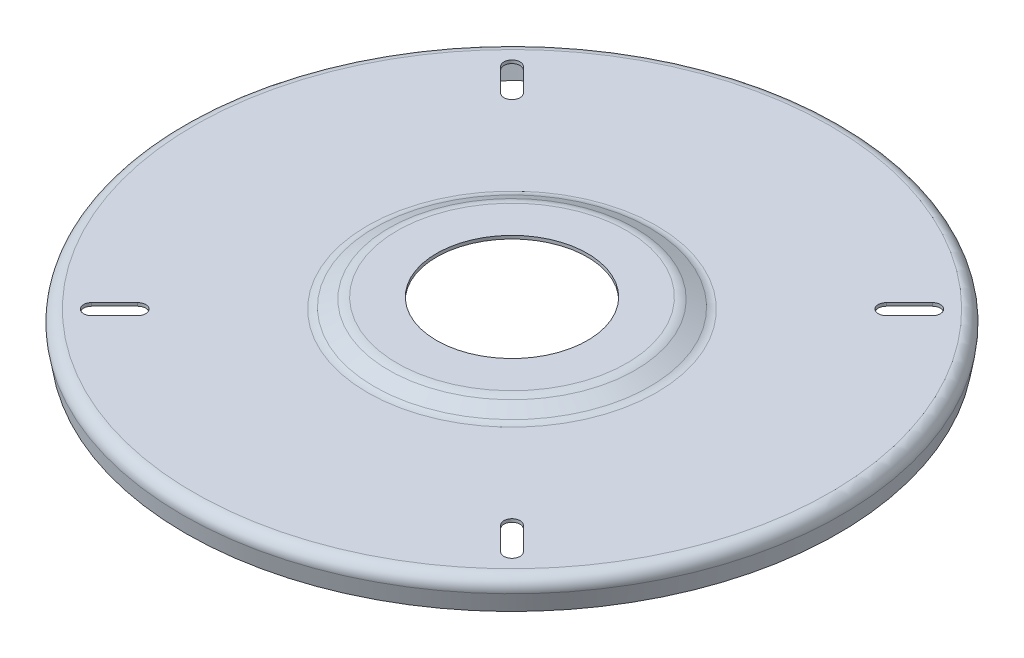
ISO-10303-21;
HEADER;
FILE_DESCRIPTION(('STEP AP214'),'2;1');
FILE_NAME('part.step','',(''),(''),'','','');
FILE_SCHEMA(('AUTOMOTIVE_DESIGN { 1 0 10303 214 1 1 1 1 }'));
ENDSEC;
DATA;
#1=APPLICATION_CONTEXT('core data for automotive mechanical design processes');
#2=APPLICATION_PROTOCOL_DEFINITION('international standard','automotive_design',2000,#1);
#3=PRODUCT_CONTEXT('',#1,'mechanical');
#4=PRODUCT('Part','Part','',(#3));
#5=PRODUCT_RELATED_PRODUCT_CATEGORY('part','',(#4));
#6=PRODUCT_DEFINITION_FORMATION('','',#4);
#7=PRODUCT_DEFINITION_CONTEXT('part definition',#1,'design');
#8=PRODUCT_DEFINITION('design','',#6,#7);
#9=PRODUCT_DEFINITION_SHAPE('','',#8);
#10=(LENGTH_UNIT() NAMED_UNIT(*) SI_UNIT(.MILLI.,.METRE.));
#11=(NAMED_UNIT(*) PLANE_ANGLE_UNIT() SI_UNIT($,.RADIAN.));
#12=(NAMED_UNIT(*) SI_UNIT($,.STERADIAN.) SOLID_ANGLE_UNIT());
#13=UNCERTAINTY_MEASURE_WITH_UNIT(LENGTH_MEASURE(1.E-05),#10,'distance_accuracy_value','');
#14=(GEOMETRIC_REPRESENTATION_CONTEXT(3) GLOBAL_UNCERTAINTY_ASSIGNED_CONTEXT((#13)) GLOBAL_UNIT_ASSIGNED_CONTEXT((#10,
#11,#12)) REPRESENTATION_CONTEXT('',''));
#15=CARTESIAN_POINT('',(0.,0.,0.));
#16=DIRECTION('',(0.,0.,1.));
#17=DIRECTION('',(1.,0.,0.));
#18=AXIS2_PLACEMENT_3D('',#15,#16,#17);
#19=CARTESIAN_POINT('',(0.,39.5209426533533,0.));
#20=DIRECTION('',(0.,-1.,0.));
#21=DIRECTION('',(0.,0.,-1.));
#22=AXIS2_PLACEMENT_3D('',#19,#20,#21);
#23=PLANE('',#22);
#24=CARTESIAN_POINT('',(0.,39.5209426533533,0.));
#25=DIRECTION('',(0.,1.,0.));
#26=DIRECTION('',(0.,0.,1.));
#27=AXIS2_PLACEMENT_3D('',#24,#25,#26);
#28=CIRCLE('',#27,71.5);
#29=CARTESIAN_POINT('',(0.,39.5209426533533,71.5));
#30=VERTEX_POINT('',#29);
#31=EDGE_CURVE('E275',#30,#30,#28,.T.);
#32=ORIENTED_EDGE('',*,*,#31,.F.);
#33=EDGE_LOOP('',(#32));
#34=FACE_BOUND('',#33,.T.);
#35=CARTESIAN_POINT('',(0.,39.5209426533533,0.));
#36=DIRECTION('',(0.,-1.,0.));
#37=DIRECTION('',(0.,0.,-1.));
#38=AXIS2_PLACEMENT_3D('',#35,#36,#37);
#39=CIRCLE('',#38,108.844372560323);
#40=CARTESIAN_POINT('',(0.,39.5209426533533,-108.844372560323));
#41=VERTEX_POINT('',#40);
#42=EDGE_CURVE('E11',#41,#41,#39,.T.);
#43=ORIENTED_EDGE('',*,*,#42,.F.);
#44=EDGE_LOOP('',(#43));
#45=FACE_BOUND('',#44,.T.);
#46=ADVANCED_FACE('F34',(#34,#45),#23,.F.);
#47=CARTESIAN_POINT('',(0.,21.5209426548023,0.));
#48=DIRECTION('',(0.,-1.,0.));
#49=DIRECTION('',(0.,0.,-1.));
#50=AXIS2_PLACEMENT_3D('',#47,#48,#49);
#51=TOROIDAL_SURFACE('',#50,108.844372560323,17.999999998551);
#52=CARTESIAN_POINT('',(0.,37.6992354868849,0.));
#53=DIRECTION('',(0.,-1.,0.));
#54=DIRECTION('',(0.,0.,-1.));
#55=AXIS2_PLACEMENT_3D('',#52,#53,#54);
#56=CIRCLE('',#55,116.735053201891);
#57=CARTESIAN_POINT('',(0.,37.6992354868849,-116.735053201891));
#58=VERTEX_POINT('',#57);
#59=EDGE_CURVE('E41',#58,#58,#56,.T.);
#60=ORIENTED_EDGE('',*,*,#59,.F.);
#61=EDGE_LOOP('',(#60));
#62=FACE_BOUND('',#61,.T.);
#63=ORIENTED_EDGE('',*,*,#42,.T.);
#64=EDGE_LOOP('',(#63));
#65=FACE_BOUND('',#64,.T.);
#66=ADVANCED_FACE('F321',(#62,#65),#51,.T.);
#67=CARTESIAN_POINT('',(0.,37.6992354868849,0.));
#68=DIRECTION('',(0.,-1.,0.));
#69=DIRECTION('',(0.,0.,-1.));
#70=AXIS2_PLACEMENT_3D('',#67,#68,#69);
#71=CONICAL_SURFACE('',#70,116.735053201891,1.11701072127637);
#72=CARTESIAN_POINT('',(0.,31.0390319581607,0.));
#73=DIRECTION('',(0.,-1.,0.));
#74=DIRECTION('',(0.,0.,-1.));
#75=AXIS2_PLACEMENT_3D('',#72,#73,#74);
#76=CIRCLE('',#75,130.390494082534);
#77=CARTESIAN_POINT('',(0.,31.0390319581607,-130.390494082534));
#78=VERTEX_POINT('',#77);
#79=EDGE_CURVE('E314',#78,#78,#76,.T.);
#80=ORIENTED_EDGE('',*,*,#79,.F.);
#81=EDGE_LOOP('',(#80));
#82=FACE_BOUND('',#81,.T.);
#83=ORIENTED_EDGE('',*,*,#59,.T.);
#84=EDGE_LOOP('',(#83));
#85=FACE_BOUND('',#84,.T.);
#86=ADVANCED_FACE('F319',(#82,#85),#71,.T.);
#87=CARTESIAN_POINT('',(0.,44.5209426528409,0.));
#88=DIRECTION('',(0.,-1.,0.));
#89=DIRECTION('',(0.,0.,-1.));
#90=AXIS2_PLACEMENT_3D('',#87,#88,#89);
#91=TOROIDAL_SURFACE('',#90,136.966061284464,15.0000000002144);
#92=CARTESIAN_POINT('',(0.,29.5209426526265,0.));
#93=DIRECTION('',(0.,-1.,0.));
#94=DIRECTION('',(0.,0.,-1.));
#95=AXIS2_PLACEMENT_3D('',#92,#93,#94);
#96=CIRCLE('',#95,136.966061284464);
#97=CARTESIAN_POINT('',(0.,29.5209426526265,-136.966061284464));
#98=VERTEX_POINT('',#97);
#99=EDGE_CURVE('E311',#98,#98,#96,.T.);
#100=ORIENTED_EDGE('',*,*,#99,.F.);
#101=EDGE_LOOP('',(#100));
#102=FACE_BOUND('',#101,.T.);
#103=ORIENTED_EDGE('',*,*,#79,.T.);
#104=EDGE_LOOP('',(#103));
#105=FACE_BOUND('',#104,.T.);
#106=ADVANCED_FACE('F401',(#102,#105),#91,.F.);
#107=CARTESIAN_POINT('',(-136.966061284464,29.5209426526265,0.));
#108=DIRECTION('',(0.,-1.,0.));
#109=DIRECTION('',(0.,0.,-1.));
#110=AXIS2_PLACEMENT_3D('',#107,#108,#109);
#111=PLANE('',#110);
#112=DIRECTION('',(0.707106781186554,0.,-0.707106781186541));
#113=VECTOR('',#112,1.);
#114=CARTESIAN_POINT('',(182.702250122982,29.5209426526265,-171.954227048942));
#115=LINE('',#114,#113);
#116=CARTESIAN_POINT('',(182.702250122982,29.5209426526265,-171.954227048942));
#117=VERTEX_POINT('',#116);
#118=CARTESIAN_POINT('',(204.495281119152,29.5209426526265,-193.747258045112));
#119=VERTEX_POINT('',#118);
#120=EDGE_CURVE('E168',#117,#119,#115,.T.);
#121=ORIENTED_EDGE('',*,*,#120,.F.);
#122=CARTESIAN_POINT('',(177.328238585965,29.5209426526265,-177.32823858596));
#123=DIRECTION('',(0.,1.,0.));
#124=DIRECTION('',(1.,0.,0.));
#125=AXIS2_PLACEMENT_3D('',#122,#123,#124);
#126=CIRCLE('',#125,7.6);
#127=CARTESIAN_POINT('',(171.954227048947,29.5209426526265,-182.702250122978));
#128=VERTEX_POINT('',#127);
#129=EDGE_CURVE('E48',#128,#117,#126,.T.);
#130=ORIENTED_EDGE('',*,*,#129,.F.);
#131=DIRECTION('',(-0.707106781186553,0.,0.707106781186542));
#132=VECTOR('',#131,1.);
#133=CARTESIAN_POINT('',(193.747258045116,29.5209426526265,-204.495281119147));
#134=LINE('',#133,#132);
#135=CARTESIAN_POINT('',(193.747258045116,29.5209426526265,-204.495281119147));
#136=VERTEX_POINT('',#135);
#137=EDGE_CURVE('E154',#136,#128,#134,.T.);
#138=ORIENTED_EDGE('',*,*,#137,.F.);
#139=CARTESIAN_POINT('',(199.121269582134,29.5209426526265,-199.121269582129));
#140=DIRECTION('',(0.,1.,0.));
#141=DIRECTION('',(1.,0.,0.));
#142=AXIS2_PLACEMENT_3D('',#139,#140,#141);
#143=CIRCLE('',#142,7.60000000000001);
#144=EDGE_CURVE('E174',#119,#136,#143,.T.);
#145=ORIENTED_EDGE('',*,*,#144,.F.);
#146=EDGE_LOOP('',(#121,#130,#138,#145));
#147=FACE_BOUND('',#146,.T.);
#148=DIRECTION('',(-0.707106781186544,0.,-0.707106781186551));
#149=VECTOR('',#148,1.);
#150=CARTESIAN_POINT('',(-171.954227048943,29.5209426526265,-182.702250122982));
#151=LINE('',#150,#149);
#152=CARTESIAN_POINT('',(-171.954227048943,29.5209426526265,-182.702250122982));
#153=VERTEX_POINT('',#152);
#154=CARTESIAN_POINT('',(-193.747258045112,29.5209426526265,-204.495281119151));
#155=VERTEX_POINT('',#154);
#156=EDGE_CURVE('E192',#153,#155,#151,.T.);
#157=ORIENTED_EDGE('',*,*,#156,.F.);
#158=CARTESIAN_POINT('',(-177.328238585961,29.5209426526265,-177.328238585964));
#159=DIRECTION('',(0.,1.,0.));
#160=DIRECTION('',(0.,0.,-1.));
#161=AXIS2_PLACEMENT_3D('',#158,#159,#160);
#162=CIRCLE('',#161,7.6);
#163=CARTESIAN_POINT('',(-182.702250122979,29.5209426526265,-171.954227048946));
#164=VERTEX_POINT('',#163);
#165=EDGE_CURVE('E190',#164,#153,#162,.T.);
#166=ORIENTED_EDGE('',*,*,#165,.F.);
#167=DIRECTION('',(0.707106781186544,0.,0.707106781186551));
#168=VECTOR('',#167,1.);
#169=CARTESIAN_POINT('',(-204.495281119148,29.5209426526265,-193.747258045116));
#170=LINE('',#169,#168);
#171=CARTESIAN_POINT('',(-204.495281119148,29.5209426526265,-193.747258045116));
#172=VERTEX_POINT('',#171);
#173=EDGE_CURVE('E198',#172,#164,#170,.T.);
#174=ORIENTED_EDGE('',*,*,#173,.F.);
#175=CARTESIAN_POINT('',(-199.12126958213,29.5209426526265,-199.121269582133));
#176=DIRECTION('',(0.,1.,0.));
#177=DIRECTION('',(0.,0.,-1.));
#178=AXIS2_PLACEMENT_3D('',#175,#176,#177);
#179=CIRCLE('',#178,7.60000000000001);
#180=EDGE_CURVE('E195',#155,#172,#179,.T.);
#181=ORIENTED_EDGE('',*,*,#180,.F.);
#182=EDGE_LOOP('',(#157,#166,#174,#181));
#183=FACE_BOUND('',#182,.T.);
#184=DIRECTION('',(-0.707106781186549,0.,0.707106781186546));
#185=VECTOR('',#184,1.);
#186=CARTESIAN_POINT('',(-182.702250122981,29.5209426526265,171.954227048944));
#187=LINE('',#186,#185);
#188=CARTESIAN_POINT('',(-182.702250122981,29.5209426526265,171.954227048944));
#189=VERTEX_POINT('',#188);
#190=CARTESIAN_POINT('',(-204.495281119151,29.5209426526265,193.747258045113));
#191=VERTEX_POINT('',#190);
#192=EDGE_CURVE('E223',#189,#191,#187,.T.);
#193=ORIENTED_EDGE('',*,*,#192,.F.);
#194=CARTESIAN_POINT('',(-177.328238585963,29.5209426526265,177.328238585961));
#195=DIRECTION('',(0.,1.,0.));
#196=DIRECTION('',(-1.,0.,0.));
#197=AXIS2_PLACEMENT_3D('',#194,#195,#196);
#198=CIRCLE('',#197,7.6);
#199=CARTESIAN_POINT('',(-171.954227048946,29.5209426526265,182.702250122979));
#200=VERTEX_POINT('',#199);
#201=EDGE_CURVE('E221',#200,#189,#198,.T.);
#202=ORIENTED_EDGE('',*,*,#201,.F.);
#203=DIRECTION('',(0.707106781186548,0.,-0.707106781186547));
#204=VECTOR('',#203,1.);
#205=CARTESIAN_POINT('',(-193.747258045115,29.5209426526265,204.495281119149));
#206=LINE('',#205,#204);
#207=CARTESIAN_POINT('',(-193.747258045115,29.5209426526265,204.495281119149));
#208=VERTEX_POINT('',#207);
#209=EDGE_CURVE('E229',#208,#200,#206,.T.);
#210=ORIENTED_EDGE('',*,*,#209,.F.);
#211=CARTESIAN_POINT('',(-199.121269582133,29.5209426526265,199.121269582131));
#212=DIRECTION('',(0.,1.,0.));
#213=DIRECTION('',(-1.,0.,0.));
#214=AXIS2_PLACEMENT_3D('',#211,#212,#213);
#215=CIRCLE('',#214,7.60000000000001);
#216=EDGE_CURVE('E226',#191,#208,#215,.T.);
#217=ORIENTED_EDGE('',*,*,#216,.F.);
#218=EDGE_LOOP('',(#193,#202,#210,#217));
#219=FACE_BOUND('',#218,.T.);
#220=DIRECTION('',(0.707106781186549,0.,0.707106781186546));
#221=VECTOR('',#220,1.);
#222=CARTESIAN_POINT('',(171.954227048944,29.5209426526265,182.702250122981));
#223=LINE('',#222,#221);
#224=CARTESIAN_POINT('',(171.954227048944,29.5209426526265,182.702250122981));
#225=VERTEX_POINT('',#224);
#226=CARTESIAN_POINT('',(193.747258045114,29.5209426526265,204.49528111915));
#227=VERTEX_POINT('',#226);
#228=EDGE_CURVE('E254',#225,#227,#223,.T.);
#229=ORIENTED_EDGE('',*,*,#228,.F.);
#230=CARTESIAN_POINT('',(177.328238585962,29.5209426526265,177.328238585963));
#231=DIRECTION('',(0.,1.,0.));
#232=DIRECTION('',(0.,0.,1.));
#233=AXIS2_PLACEMENT_3D('',#230,#231,#232);
#234=CIRCLE('',#233,7.6);
#235=CARTESIAN_POINT('',(182.70225012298,29.5209426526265,171.954227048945));
#236=VERTEX_POINT('',#235);
#237=EDGE_CURVE('E252',#236,#225,#234,.T.);
#238=ORIENTED_EDGE('',*,*,#237,.F.);
#239=DIRECTION('',(-0.707106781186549,0.,-0.707106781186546));
#240=VECTOR('',#239,1.);
#241=CARTESIAN_POINT('',(204.495281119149,29.5209426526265,193.747258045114));
#242=LINE('',#241,#240);
#243=CARTESIAN_POINT('',(204.495281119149,29.5209426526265,193.747258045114));
#244=VERTEX_POINT('',#243);
#245=EDGE_CURVE('E260',#244,#236,#242,.T.);
#246=ORIENTED_EDGE('',*,*,#245,.F.);
#247=CARTESIAN_POINT('',(199.121269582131,29.5209426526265,199.121269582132));
#248=DIRECTION('',(0.,1.,0.));
#249=DIRECTION('',(0.,0.,1.));
#250=AXIS2_PLACEMENT_3D('',#247,#248,#249);
#251=CIRCLE('',#250,7.60000000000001);
#252=EDGE_CURVE('E257',#227,#244,#251,.T.);
#253=ORIENTED_EDGE('',*,*,#252,.F.);
#254=EDGE_LOOP('',(#229,#238,#246,#253));
#255=FACE_BOUND('',#254,.T.);
#256=CARTESIAN_POINT('',(0.,29.5209426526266,0.));
#257=DIRECTION('',(0.,-1.,0.));
#258=DIRECTION('',(0.,0.,-1.));
#259=AXIS2_PLACEMENT_3D('',#256,#257,#258);
#260=CIRCLE('',#259,301.277);
#261=CARTESIAN_POINT('',(0.,29.5209426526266,-301.277));
#262=VERTEX_POINT('',#261);
#263=EDGE_CURVE('E308',#262,#262,#260,.T.);
#264=ORIENTED_EDGE('',*,*,#263,.F.);
#265=EDGE_LOOP('',(#264));
#266=FACE_BOUND('',#265,.T.);
#267=ORIENTED_EDGE('',*,*,#99,.T.);
#268=EDGE_LOOP('',(#267));
#269=FACE_BOUND('',#268,.T.);
#270=ADVANCED_FACE('F395',(#147,#183,#219,#255,#266,#269),#111,.F.);
#271=CARTESIAN_POINT('',(0.,18.5208261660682,0.));
#272=DIRECTION('',(0.,-1.,0.));
#273=DIRECTION('',(0.,0.,-1.));
#274=AXIS2_PLACEMENT_3D('',#271,#272,#273);
#275=TOROIDAL_SURFACE('',#274,301.277,11.0001164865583);
#276=CARTESIAN_POINT('',(0.,16.6106759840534,0.));
#277=DIRECTION('',(0.,-1.,0.));
#278=DIRECTION('',(0.,0.,-1.));
#279=AXIS2_PLACEMENT_3D('',#276,#277,#278);
#280=CIRCLE('',#279,312.11);
#281=CARTESIAN_POINT('',(0.,16.6106759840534,-312.11));
#282=VERTEX_POINT('',#281);
#283=EDGE_CURVE('E305',#282,#282,#280,.T.);
#284=ORIENTED_EDGE('',*,*,#283,.F.);
#285=EDGE_LOOP('',(#284));
#286=FACE_BOUND('',#285,.T.);
#287=ORIENTED_EDGE('',*,*,#263,.T.);
#288=EDGE_LOOP('',(#287));
#289=FACE_BOUND('',#288,.T.);
#290=ADVANCED_FACE('F389',(#286,#289),#275,.T.);
#291=CARTESIAN_POINT('',(0.,16.6106759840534,0.));
#292=DIRECTION('',(0.,1.,0.));
#293=DIRECTION('',(0.,0.,1.));
#294=AXIS2_PLACEMENT_3D('',#291,#292,#293);
#295=CONICAL_SURFACE('',#294,312.11,0.174532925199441);
#296=CARTESIAN_POINT('',(0.,0.,0.));
#297=DIRECTION('',(0.,-1.,0.));
#298=DIRECTION('',(0.,0.,-1.));
#299=AXIS2_PLACEMENT_3D('',#296,#297,#298);
#300=CIRCLE('',#299,309.181089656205);
#301=CARTESIAN_POINT('',(0.,0.,-309.181089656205));
#302=VERTEX_POINT('',#301);
#303=EDGE_CURVE('E302',#302,#302,#300,.T.);
#304=ORIENTED_EDGE('',*,*,#303,.F.);
#305=EDGE_LOOP('',(#304));
#306=FACE_BOUND('',#305,.T.);
#307=ORIENTED_EDGE('',*,*,#283,.T.);
#308=EDGE_LOOP('',(#307));
#309=FACE_BOUND('',#308,.T.);
#310=ADVANCED_FACE('F383',(#306,#309),#295,.T.);
#311=CARTESIAN_POINT('',(0.,0.,0.));
#312=DIRECTION('',(0.,-1.,0.));
#313=DIRECTION('',(0.,0.,-1.));
#314=AXIS2_PLACEMENT_3D('',#311,#312,#313);
#315=CONICAL_SURFACE('',#314,309.181089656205,1.39626340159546);
#316=CARTESIAN_POINT('',(0.,0.520944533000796,0.));
#317=DIRECTION('',(0.,-1.,0.));
#318=DIRECTION('',(0.,0.,-1.));
#319=AXIS2_PLACEMENT_3D('',#316,#317,#318);
#320=CIRCLE('',#319,306.226666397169);
#321=CARTESIAN_POINT('',(0.,0.520944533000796,-306.226666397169));
#322=VERTEX_POINT('',#321);
#323=EDGE_CURVE('E299',#322,#322,#320,.T.);
#324=ORIENTED_EDGE('',*,*,#323,.F.);
#325=EDGE_LOOP('',(#324));
#326=FACE_BOUND('',#325,.T.);
#327=ORIENTED_EDGE('',*,*,#303,.T.);
#328=EDGE_LOOP('',(#327));
#329=FACE_BOUND('',#328,.T.);
#330=ADVANCED_FACE('F377',(#326,#329),#315,.F.);
#331=CARTESIAN_POINT('',(0.,0.520944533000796,0.));
#332=DIRECTION('',(0.,1.,0.));
#333=DIRECTION('',(0.,0.,1.));
#334=AXIS2_PLACEMENT_3D('',#331,#332,#333);
#335=CONICAL_SURFACE('',#334,306.226666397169,0.174532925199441);
#336=CARTESIAN_POINT('',(0.,17.1316205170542,0.));
#337=DIRECTION('',(0.,-1.,0.));
#338=DIRECTION('',(0.,0.,-1.));
#339=AXIS2_PLACEMENT_3D('',#336,#337,#338);
#340=CIRCLE('',#339,309.155576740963);
#341=CARTESIAN_POINT('',(0.,17.1316205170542,-309.155576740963));
#342=VERTEX_POINT('',#341);
#343=EDGE_CURVE('E296',#342,#342,#340,.T.);
#344=ORIENTED_EDGE('',*,*,#343,.F.);
#345=EDGE_LOOP('',(#344));
#346=FACE_BOUND('',#345,.T.);
#347=ORIENTED_EDGE('',*,*,#323,.T.);
#348=EDGE_LOOP('',(#347));
#349=FACE_BOUND('',#348,.T.);
#350=ADVANCED_FACE('F371',(#346,#349),#335,.F.);
#351=CARTESIAN_POINT('',(0.,18.5208261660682,0.));
#352=DIRECTION('',(0.,-1.,0.));
#353=DIRECTION('',(0.,0.,-1.));
#354=AXIS2_PLACEMENT_3D('',#351,#352,#353);
#355=TOROIDAL_SURFACE('',#354,301.277,8.00011648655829);
#356=CARTESIAN_POINT('',(0.,26.5209426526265,0.));
#357=DIRECTION('',(0.,-1.,0.));
#358=DIRECTION('',(0.,0.,-1.));
#359=AXIS2_PLACEMENT_3D('',#356,#357,#358);
#360=CIRCLE('',#359,301.277);
#361=CARTESIAN_POINT('',(0.,26.5209426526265,-301.277));
#362=VERTEX_POINT('',#361);
#363=EDGE_CURVE('E293',#362,#362,#360,.T.);
#364=ORIENTED_EDGE('',*,*,#363,.F.);
#365=EDGE_LOOP('',(#364));
#366=FACE_BOUND('',#365,.T.);
#367=ORIENTED_EDGE('',*,*,#343,.T.);
#368=EDGE_LOOP('',(#367));
#369=FACE_BOUND('',#368,.T.);
#370=ADVANCED_FACE('F365',(#366,#369),#355,.F.);
#371=CARTESIAN_POINT('',(-136.966061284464,26.5209426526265,0.));
#372=DIRECTION('',(0.,1.,0.));
#373=DIRECTION('',(0.,0.,1.));
#374=AXIS2_PLACEMENT_3D('',#371,#372,#373);
#375=PLANE('',#374);
#376=DIRECTION('',(0.707106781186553,0.,-0.707106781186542));
#377=VECTOR('',#376,1.);
#378=CARTESIAN_POINT('',(193.747258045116,26.5209426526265,-204.495281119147));
#379=LINE('',#378,#377);
#380=CARTESIAN_POINT('',(171.954227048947,26.5209426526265,-182.702250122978));
#381=VERTEX_POINT('',#380);
#382=CARTESIAN_POINT('',(193.747258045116,26.5209426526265,-204.495281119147));
#383=VERTEX_POINT('',#382);
#384=EDGE_CURVE('E166',#381,#383,#379,.T.);
#385=ORIENTED_EDGE('',*,*,#384,.F.);
#386=CARTESIAN_POINT('',(177.328238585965,26.5209426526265,-177.32823858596));
#387=DIRECTION('',(0.,1.,0.));
#388=DIRECTION('',(0.,0.,1.));
#389=AXIS2_PLACEMENT_3D('',#386,#387,#388);
#390=CIRCLE('',#389,7.6);
#391=CARTESIAN_POINT('',(182.702250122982,26.5209426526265,-171.954227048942));
#392=VERTEX_POINT('',#391);
#393=EDGE_CURVE('E148',#392,#381,#390,.F.);
#394=ORIENTED_EDGE('',*,*,#393,.F.);
#395=DIRECTION('',(-0.707106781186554,0.,0.707106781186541));
#396=VECTOR('',#395,1.);
#397=CARTESIAN_POINT('',(182.702250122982,26.5209426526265,-171.954227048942));
#398=LINE('',#397,#396);
#399=CARTESIAN_POINT('',(204.495281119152,26.5209426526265,-193.747258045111));
#400=VERTEX_POINT('',#399);
#401=EDGE_CURVE('E157',#400,#392,#398,.T.);
#402=ORIENTED_EDGE('',*,*,#401,.F.);
#403=CARTESIAN_POINT('',(199.121269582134,26.5209426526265,-199.121269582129));
#404=DIRECTION('',(0.,1.,0.));
#405=DIRECTION('',(0.,0.,1.));
#406=AXIS2_PLACEMENT_3D('',#403,#404,#405);
#407=CIRCLE('',#406,7.60000000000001);
#408=EDGE_CURVE('E56',#383,#400,#407,.F.);
#409=ORIENTED_EDGE('',*,*,#408,.F.);
#410=EDGE_LOOP('',(#385,#394,#402,#409));
#411=FACE_BOUND('',#410,.T.);
#412=DIRECTION('',(-0.707106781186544,0.,-0.707106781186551));
#413=VECTOR('',#412,1.);
#414=CARTESIAN_POINT('',(-204.495281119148,26.5209426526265,-193.747258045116));
#415=LINE('',#414,#413);
#416=CARTESIAN_POINT('',(-182.702250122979,26.5209426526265,-171.954227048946));
#417=VERTEX_POINT('',#416);
#418=CARTESIAN_POINT('',(-204.495281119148,26.5209426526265,-193.747258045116));
#419=VERTEX_POINT('',#418);
#420=EDGE_CURVE('E184',#417,#419,#415,.T.);
#421=ORIENTED_EDGE('',*,*,#420,.F.);
#422=CARTESIAN_POINT('',(-177.328238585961,26.5209426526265,-177.328238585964));
#423=DIRECTION('',(0.,1.,0.));
#424=DIRECTION('',(0.,0.,1.));
#425=AXIS2_PLACEMENT_3D('',#422,#423,#424);
#426=CIRCLE('',#425,7.6);
#427=CARTESIAN_POINT('',(-171.954227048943,26.5209426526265,-182.702250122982));
#428=VERTEX_POINT('',#427);
#429=EDGE_CURVE('E187',#428,#417,#426,.F.);
#430=ORIENTED_EDGE('',*,*,#429,.F.);
#431=DIRECTION('',(0.707106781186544,0.,0.707106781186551));
#432=VECTOR('',#431,1.);
#433=CARTESIAN_POINT('',(-171.954227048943,26.5209426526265,-182.702250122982));
#434=LINE('',#433,#432);
#435=CARTESIAN_POINT('',(-193.747258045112,26.5209426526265,-204.495281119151));
#436=VERTEX_POINT('',#435);
#437=EDGE_CURVE('E204',#436,#428,#434,.T.);
#438=ORIENTED_EDGE('',*,*,#437,.F.);
#439=CARTESIAN_POINT('',(-199.12126958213,26.5209426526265,-199.121269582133));
#440=DIRECTION('',(0.,1.,0.));
#441=DIRECTION('',(0.,0.,1.));
#442=AXIS2_PLACEMENT_3D('',#439,#440,#441);
#443=CIRCLE('',#442,7.60000000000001);
#444=EDGE_CURVE('E160',#419,#436,#443,.F.);
#445=ORIENTED_EDGE('',*,*,#444,.F.);
#446=EDGE_LOOP('',(#421,#430,#438,#445));
#447=FACE_BOUND('',#446,.T.);
#448=DIRECTION('',(-0.707106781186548,0.,0.707106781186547));
#449=VECTOR('',#448,1.);
#450=CARTESIAN_POINT('',(-193.747258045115,26.5209426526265,204.495281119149));
#451=LINE('',#450,#449);
#452=CARTESIAN_POINT('',(-171.954227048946,26.5209426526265,182.702250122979));
#453=VERTEX_POINT('',#452);
#454=CARTESIAN_POINT('',(-193.747258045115,26.5209426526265,204.495281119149));
#455=VERTEX_POINT('',#454);
#456=EDGE_CURVE('E215',#453,#455,#451,.T.);
#457=ORIENTED_EDGE('',*,*,#456,.F.);
#458=CARTESIAN_POINT('',(-177.328238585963,26.5209426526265,177.328238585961));
#459=DIRECTION('',(0.,1.,0.));
#460=DIRECTION('',(0.,0.,1.));
#461=AXIS2_PLACEMENT_3D('',#458,#459,#460);
#462=CIRCLE('',#461,7.6);
#463=CARTESIAN_POINT('',(-182.702250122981,26.5209426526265,171.954227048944));
#464=VERTEX_POINT('',#463);
#465=EDGE_CURVE('E218',#464,#453,#462,.F.);
#466=ORIENTED_EDGE('',*,*,#465,.F.);
#467=DIRECTION('',(0.707106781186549,0.,-0.707106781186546));
#468=VECTOR('',#467,1.);
#469=CARTESIAN_POINT('',(-182.702250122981,26.5209426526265,171.954227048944));
#470=LINE('',#469,#468);
#471=CARTESIAN_POINT('',(-204.495281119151,26.5209426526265,193.747258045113));
#472=VERTEX_POINT('',#471);
#473=EDGE_CURVE('E235',#472,#464,#470,.T.);
#474=ORIENTED_EDGE('',*,*,#473,.F.);
#475=CARTESIAN_POINT('',(-199.121269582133,26.5209426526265,199.121269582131));
#476=DIRECTION('',(0.,1.,0.));
#477=DIRECTION('',(0.,0.,1.));
#478=AXIS2_PLACEMENT_3D('',#475,#476,#477);
#479=CIRCLE('',#478,7.60000000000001);
#480=EDGE_CURVE('E213',#455,#472,#479,.F.);
#481=ORIENTED_EDGE('',*,*,#480,.F.);
#482=EDGE_LOOP('',(#457,#466,#474,#481));
#483=FACE_BOUND('',#482,.T.);
#484=DIRECTION('',(0.707106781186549,0.,0.707106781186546));
#485=VECTOR('',#484,1.);
#486=CARTESIAN_POINT('',(204.495281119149,26.5209426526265,193.747258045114));
#487=LINE('',#486,#485);
#488=CARTESIAN_POINT('',(182.70225012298,26.5209426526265,171.954227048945));
#489=VERTEX_POINT('',#488);
#490=CARTESIAN_POINT('',(204.495281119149,26.5209426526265,193.747258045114));
#491=VERTEX_POINT('',#490);
#492=EDGE_CURVE('E246',#489,#491,#487,.T.);
#493=ORIENTED_EDGE('',*,*,#492,.F.);
#494=CARTESIAN_POINT('',(177.328238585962,26.5209426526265,177.328238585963));
#495=DIRECTION('',(0.,1.,0.));
#496=DIRECTION('',(0.,0.,1.));
#497=AXIS2_PLACEMENT_3D('',#494,#495,#496);
#498=CIRCLE('',#497,7.6);
#499=CARTESIAN_POINT('',(171.954227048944,26.5209426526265,182.702250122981));
#500=VERTEX_POINT('',#499);
#501=EDGE_CURVE('E249',#500,#489,#498,.F.);
#502=ORIENTED_EDGE('',*,*,#501,.F.);
#503=DIRECTION('',(-0.707106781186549,0.,-0.707106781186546));
#504=VECTOR('',#503,1.);
#505=CARTESIAN_POINT('',(171.954227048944,26.5209426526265,182.702250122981));
#506=LINE('',#505,#504);
#507=CARTESIAN_POINT('',(193.747258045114,26.5209426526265,204.49528111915));
#508=VERTEX_POINT('',#507);
#509=EDGE_CURVE('E266',#508,#500,#506,.T.);
#510=ORIENTED_EDGE('',*,*,#509,.F.);
#511=CARTESIAN_POINT('',(199.121269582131,26.5209426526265,199.121269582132));
#512=DIRECTION('',(0.,1.,0.));
#513=DIRECTION('',(0.,0.,1.));
#514=AXIS2_PLACEMENT_3D('',#511,#512,#513);
#515=CIRCLE('',#514,7.60000000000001);
#516=EDGE_CURVE('E244',#491,#508,#515,.F.);
#517=ORIENTED_EDGE('',*,*,#516,.F.);
#518=EDGE_LOOP('',(#493,#502,#510,#517));
#519=FACE_BOUND('',#518,.T.);
#520=CARTESIAN_POINT('',(0.,26.5209426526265,0.));
#521=DIRECTION('',(0.,-1.,0.));
#522=DIRECTION('',(0.,0.,-1.));
#523=AXIS2_PLACEMENT_3D('',#520,#521,#522);
#524=CIRCLE('',#523,136.966061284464);
#525=CARTESIAN_POINT('',(0.,26.5209426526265,-136.966061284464));
#526=VERTEX_POINT('',#525);
#527=EDGE_CURVE('E290',#526,#526,#524,.T.);
#528=ORIENTED_EDGE('',*,*,#527,.F.);
#529=EDGE_LOOP('',(#528));
#530=FACE_BOUND('',#529,.T.);
#531=ORIENTED_EDGE('',*,*,#363,.T.);
#532=EDGE_LOOP('',(#531));
#533=FACE_BOUND('',#532,.T.);
#534=ADVANCED_FACE('F163',(#411,#447,#483,#519,#530,#533),#375,.F.);
#535=CARTESIAN_POINT('',(0.,44.5209426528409,0.));
#536=DIRECTION('',(0.,-1.,0.));
#537=DIRECTION('',(0.,0.,-1.));
#538=AXIS2_PLACEMENT_3D('',#535,#536,#537);
#539=TOROIDAL_SURFACE('',#538,136.966061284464,18.0000000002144);
#540=CARTESIAN_POINT('',(0.,28.3426498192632,0.));
#541=DIRECTION('',(0.,-1.,0.));
#542=DIRECTION('',(0.,0.,-1.));
#543=AXIS2_PLACEMENT_3D('',#540,#541,#542);
#544=CIRCLE('',#543,129.075380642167);
#545=CARTESIAN_POINT('',(0.,28.3426498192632,-129.075380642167));
#546=VERTEX_POINT('',#545);
#547=EDGE_CURVE('E287',#546,#546,#544,.T.);
#548=ORIENTED_EDGE('',*,*,#547,.F.);
#549=EDGE_LOOP('',(#548));
#550=FACE_BOUND('',#549,.T.);
#551=ORIENTED_EDGE('',*,*,#527,.T.);
#552=EDGE_LOOP('',(#551));
#553=FACE_BOUND('',#552,.T.);
#554=ADVANCED_FACE('F354',(#550,#553),#539,.T.);
#555=CARTESIAN_POINT('',(0.,28.3426498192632,0.));
#556=DIRECTION('',(0.,-1.,0.));
#557=DIRECTION('',(0.,0.,-1.));
#558=AXIS2_PLACEMENT_3D('',#555,#556,#557);
#559=CONICAL_SURFACE('',#558,129.075380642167,1.11701072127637);
#560=CARTESIAN_POINT('',(0.,35.0028533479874,0.));
#561=DIRECTION('',(0.,-1.,0.));
#562=DIRECTION('',(0.,0.,-1.));
#563=AXIS2_PLACEMENT_3D('',#560,#561,#562);
#564=CIRCLE('',#563,115.419939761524);
#565=CARTESIAN_POINT('',(0.,35.0028533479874,-115.419939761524));
#566=VERTEX_POINT('',#565);
#567=EDGE_CURVE('E284',#566,#566,#564,.T.);
#568=ORIENTED_EDGE('',*,*,#567,.F.);
#569=EDGE_LOOP('',(#568));
#570=FACE_BOUND('',#569,.T.);
#571=ORIENTED_EDGE('',*,*,#547,.T.);
#572=EDGE_LOOP('',(#571));
#573=FACE_BOUND('',#572,.T.);
#574=ADVANCED_FACE('F348',(#570,#573),#559,.F.);
#575=CARTESIAN_POINT('',(0.,21.5209426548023,0.));
#576=DIRECTION('',(0.,-1.,0.));
#577=DIRECTION('',(0.,0.,-1.));
#578=AXIS2_PLACEMENT_3D('',#575,#576,#577);
#579=TOROIDAL_SURFACE('',#578,108.844372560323,14.999999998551);
#580=CARTESIAN_POINT('',(0.,36.5209426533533,0.));
#581=DIRECTION('',(0.,-1.,0.));
#582=DIRECTION('',(0.,0.,-1.));
#583=AXIS2_PLACEMENT_3D('',#580,#581,#582);
#584=CIRCLE('',#583,108.844372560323);
#585=CARTESIAN_POINT('',(0.,36.5209426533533,-108.844372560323));
#586=VERTEX_POINT('',#585);
#587=EDGE_CURVE('E281',#586,#586,#584,.T.);
#588=ORIENTED_EDGE('',*,*,#587,.F.);
#589=EDGE_LOOP('',(#588));
#590=FACE_BOUND('',#589,.T.);
#591=ORIENTED_EDGE('',*,*,#567,.T.);
#592=EDGE_LOOP('',(#591));
#593=FACE_BOUND('',#592,.T.);
#594=ADVANCED_FACE('F342',(#590,#593),#579,.F.);
#595=CARTESIAN_POINT('',(0.,36.5209426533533,0.));
#596=DIRECTION('',(0.,1.,0.));
#597=DIRECTION('',(0.,0.,1.));
#598=AXIS2_PLACEMENT_3D('',#595,#596,#597);
#599=PLANE('',#598);
#600=CARTESIAN_POINT('',(0.,36.5209426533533,0.));
#601=DIRECTION('',(0.,1.,0.));
#602=DIRECTION('',(0.,0.,1.));
#603=AXIS2_PLACEMENT_3D('',#600,#601,#602);
#604=CIRCLE('',#603,71.5);
#605=CARTESIAN_POINT('',(0.,36.5209426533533,71.5));
#606=VERTEX_POINT('',#605);
#607=EDGE_CURVE('E278',#606,#606,#604,.F.);
#608=ORIENTED_EDGE('',*,*,#607,.F.);
#609=EDGE_LOOP('',(#608));
#610=FACE_BOUND('',#609,.T.);
#611=ORIENTED_EDGE('',*,*,#587,.T.);
#612=EDGE_LOOP('',(#611));
#613=FACE_BOUND('',#612,.T.);
#614=ADVANCED_FACE('F336',(#610,#613),#599,.F.);
#615=CARTESIAN_POINT('',(0.,-0.001000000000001,0.));
#616=DIRECTION('',(0.,1.,0.));
#617=DIRECTION('',(0.,0.,1.));
#618=AXIS2_PLACEMENT_3D('',#615,#616,#617);
#619=CYLINDRICAL_SURFACE('',#618,71.5);
#620=ORIENTED_EDGE('',*,*,#31,.T.);
#621=EDGE_LOOP('',(#620));
#622=FACE_BOUND('',#621,.T.);
#623=ORIENTED_EDGE('',*,*,#607,.T.);
#624=EDGE_LOOP('',(#623));
#625=FACE_BOUND('',#624,.T.);
#626=ADVANCED_FACE('F332',(#622,#625),#619,.F.);
#627=CARTESIAN_POINT('',(177.328238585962,-0.001000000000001,177.328238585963));
#628=DIRECTION('',(0.,1.,0.));
#629=DIRECTION('',(0.,0.,1.));
#630=AXIS2_PLACEMENT_3D('',#627,#628,#629);
#631=CYLINDRICAL_SURFACE('',#630,7.6);
#632=ORIENTED_EDGE('',*,*,#501,.T.);
#633=DIRECTION('',(0.,1.,0.));
#634=VECTOR('',#633,1.);
#635=CARTESIAN_POINT('',(182.70225012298,-0.001000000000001,171.954227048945));
#636=LINE('',#635,#634);
#637=EDGE_CURVE('E264',#489,#236,#636,.T.);
#638=ORIENTED_EDGE('',*,*,#637,.T.);
#639=ORIENTED_EDGE('',*,*,#237,.T.);
#640=DIRECTION('',(0.,1.,0.));
#641=VECTOR('',#640,1.);
#642=CARTESIAN_POINT('',(171.954227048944,-0.001000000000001,182.702250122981));
#643=LINE('',#642,#641);
#644=EDGE_CURVE('E263',#500,#225,#643,.T.);
#645=ORIENTED_EDGE('',*,*,#644,.F.);
#646=EDGE_LOOP('',(#632,#638,#639,#645));
#647=FACE_BOUND('',#646,.T.);
#648=ADVANCED_FACE('F335',(#647),#631,.F.);
#649=CARTESIAN_POINT('',(204.495281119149,-0.001000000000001,193.747258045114));
#650=DIRECTION('',(0.707106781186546,0.,-0.707106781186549));
#651=DIRECTION('',(-0.707106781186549,0.,-0.707106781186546));
#652=AXIS2_PLACEMENT_3D('',#649,#650,#651);
#653=PLANE('',#652);
#654=ORIENTED_EDGE('',*,*,#492,.T.);
#655=DIRECTION('',(0.,1.,0.));
#656=VECTOR('',#655,1.);
#657=CARTESIAN_POINT('',(204.495281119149,-0.001000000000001,193.747258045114));
#658=LINE('',#657,#656);
#659=EDGE_CURVE('E267',#491,#244,#658,.T.);
#660=ORIENTED_EDGE('',*,*,#659,.T.);
#661=ORIENTED_EDGE('',*,*,#245,.T.);
#662=ORIENTED_EDGE('',*,*,#637,.F.);
#663=EDGE_LOOP('',(#654,#660,#661,#662));
#664=FACE_BOUND('',#663,.T.);
#665=ADVANCED_FACE('F418',(#664),#653,.F.);
#666=CARTESIAN_POINT('',(199.121269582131,-0.001000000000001,199.121269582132));
#667=DIRECTION('',(0.,1.,0.));
#668=DIRECTION('',(0.,0.,1.));
#669=AXIS2_PLACEMENT_3D('',#666,#667,#668);
#670=CYLINDRICAL_SURFACE('',#669,7.60000000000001);
#671=ORIENTED_EDGE('',*,*,#516,.T.);
#672=DIRECTION('',(0.,1.,0.));
#673=VECTOR('',#672,1.);
#674=CARTESIAN_POINT('',(193.747258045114,-0.001000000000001,204.49528111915));
#675=LINE('',#674,#673);
#676=EDGE_CURVE('E269',#508,#227,#675,.T.);
#677=ORIENTED_EDGE('',*,*,#676,.T.);
#678=ORIENTED_EDGE('',*,*,#252,.T.);
#679=ORIENTED_EDGE('',*,*,#659,.F.);
#680=EDGE_LOOP('',(#671,#677,#678,#679));
#681=FACE_BOUND('',#680,.T.);
#682=ADVANCED_FACE('F424',(#681),#670,.F.);
#683=CARTESIAN_POINT('',(171.954227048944,-0.001000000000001,182.702250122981));
#684=DIRECTION('',(-0.707106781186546,0.,0.707106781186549));
#685=DIRECTION('',(0.707106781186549,0.,0.707106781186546));
#686=AXIS2_PLACEMENT_3D('',#683,#684,#685);
#687=PLANE('',#686);
#688=ORIENTED_EDGE('',*,*,#509,.T.);
#689=ORIENTED_EDGE('',*,*,#644,.T.);
#690=ORIENTED_EDGE('',*,*,#228,.T.);
#691=ORIENTED_EDGE('',*,*,#676,.F.);
#692=EDGE_LOOP('',(#688,#689,#690,#691));
#693=FACE_BOUND('',#692,.T.);
#694=ADVANCED_FACE('F420',(#693),#687,.F.);
#695=CARTESIAN_POINT('',(-177.328238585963,-0.001000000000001,177.328238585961));
#696=DIRECTION('',(0.,1.,0.));
#697=DIRECTION('',(0.,0.,1.));
#698=AXIS2_PLACEMENT_3D('',#695,#696,#697);
#699=CYLINDRICAL_SURFACE('',#698,7.6);
#700=ORIENTED_EDGE('',*,*,#465,.T.);
#701=DIRECTION('',(0.,1.,0.));
#702=VECTOR('',#701,1.);
#703=CARTESIAN_POINT('',(-171.954227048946,-0.001000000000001,182.702250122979));
#704=LINE('',#703,#702);
#705=EDGE_CURVE('E233',#453,#200,#704,.T.);
#706=ORIENTED_EDGE('',*,*,#705,.T.);
#707=ORIENTED_EDGE('',*,*,#201,.T.);
#708=DIRECTION('',(0.,1.,0.));
#709=VECTOR('',#708,1.);
#710=CARTESIAN_POINT('',(-182.702250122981,-0.001000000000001,171.954227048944));
#711=LINE('',#710,#709);
#712=EDGE_CURVE('E232',#464,#189,#711,.T.);
#713=ORIENTED_EDGE('',*,*,#712,.F.);
#714=EDGE_LOOP('',(#700,#706,#707,#713));
#715=FACE_BOUND('',#714,.T.);
#716=ADVANCED_FACE('F423',(#715),#699,.F.);
#717=CARTESIAN_POINT('',(-193.747258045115,-0.001000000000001,204.495281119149));
#718=DIRECTION('',(0.707106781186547,0.,0.707106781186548));
#719=DIRECTION('',(0.707106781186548,0.,-0.707106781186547));
#720=AXIS2_PLACEMENT_3D('',#717,#718,#719);
#721=PLANE('',#720);
#722=ORIENTED_EDGE('',*,*,#456,.T.);
#723=DIRECTION('',(0.,1.,0.));
#724=VECTOR('',#723,1.);
#725=CARTESIAN_POINT('',(-193.747258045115,-0.001000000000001,204.495281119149));
#726=LINE('',#725,#724);
#727=EDGE_CURVE('E236',#455,#208,#726,.T.);
#728=ORIENTED_EDGE('',*,*,#727,.T.);
#729=ORIENTED_EDGE('',*,*,#209,.T.);
#730=ORIENTED_EDGE('',*,*,#705,.F.);
#731=EDGE_LOOP('',(#722,#728,#729,#730));
#732=FACE_BOUND('',#731,.T.);
#733=ADVANCED_FACE('F434',(#732),#721,.F.);
#734=CARTESIAN_POINT('',(-199.121269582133,-0.001000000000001,199.121269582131));
#735=DIRECTION('',(0.,1.,0.));
#736=DIRECTION('',(0.,0.,1.));
#737=AXIS2_PLACEMENT_3D('',#734,#735,#736);
#738=CYLINDRICAL_SURFACE('',#737,7.60000000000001);
#739=ORIENTED_EDGE('',*,*,#480,.T.);
#740=DIRECTION('',(0.,1.,0.));
#741=VECTOR('',#740,1.);
#742=CARTESIAN_POINT('',(-204.495281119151,-0.001000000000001,193.747258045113));
#743=LINE('',#742,#741);
#744=EDGE_CURVE('E238',#472,#191,#743,.T.);
#745=ORIENTED_EDGE('',*,*,#744,.T.);
#746=ORIENTED_EDGE('',*,*,#216,.T.);
#747=ORIENTED_EDGE('',*,*,#727,.F.);
#748=EDGE_LOOP('',(#739,#745,#746,#747));
#749=FACE_BOUND('',#748,.T.);
#750=ADVANCED_FACE('F440',(#749),#738,.F.);
#751=CARTESIAN_POINT('',(-182.702250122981,-0.001000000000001,171.954227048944));
#752=DIRECTION('',(-0.707106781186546,0.,-0.707106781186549));
#753=DIRECTION('',(-0.707106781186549,0.,0.707106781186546));
#754=AXIS2_PLACEMENT_3D('',#751,#752,#753);
#755=PLANE('',#754);
#756=ORIENTED_EDGE('',*,*,#473,.T.);
#757=ORIENTED_EDGE('',*,*,#712,.T.);
#758=ORIENTED_EDGE('',*,*,#192,.T.);
#759=ORIENTED_EDGE('',*,*,#744,.F.);
#760=EDGE_LOOP('',(#756,#757,#758,#759));
#761=FACE_BOUND('',#760,.T.);
#762=ADVANCED_FACE('F436',(#761),#755,.F.);
#763=CARTESIAN_POINT('',(-177.328238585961,-0.001000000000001,-177.328238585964));
#764=DIRECTION('',(0.,1.,0.));
#765=DIRECTION('',(0.,0.,1.));
#766=AXIS2_PLACEMENT_3D('',#763,#764,#765);
#767=CYLINDRICAL_SURFACE('',#766,7.6);
#768=ORIENTED_EDGE('',*,*,#429,.T.);
#769=DIRECTION('',(0.,1.,0.));
#770=VECTOR('',#769,1.);
#771=CARTESIAN_POINT('',(-182.702250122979,-0.001000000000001,-171.954227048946));
#772=LINE('',#771,#770);
#773=EDGE_CURVE('E202',#417,#164,#772,.T.);
#774=ORIENTED_EDGE('',*,*,#773,.T.);
#775=ORIENTED_EDGE('',*,*,#165,.T.);
#776=DIRECTION('',(0.,1.,0.));
#777=VECTOR('',#776,1.);
#778=CARTESIAN_POINT('',(-171.954227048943,-0.001000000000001,-182.702250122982));
#779=LINE('',#778,#777);
#780=EDGE_CURVE('E201',#428,#153,#779,.T.);
#781=ORIENTED_EDGE('',*,*,#780,.F.);
#782=EDGE_LOOP('',(#768,#774,#775,#781));
#783=FACE_BOUND('',#782,.T.);
#784=ADVANCED_FACE('F439',(#783),#767,.F.);
#785=CARTESIAN_POINT('',(-204.495281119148,-0.001000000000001,-193.747258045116));
#786=DIRECTION('',(-0.707106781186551,0.,0.707106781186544));
#787=DIRECTION('',(0.707106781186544,0.,0.707106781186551));
#788=AXIS2_PLACEMENT_3D('',#785,#786,#787);
#789=PLANE('',#788);
#790=ORIENTED_EDGE('',*,*,#420,.T.);
#791=DIRECTION('',(0.,1.,0.));
#792=VECTOR('',#791,1.);
#793=CARTESIAN_POINT('',(-204.495281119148,-0.001000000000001,-193.747258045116));
#794=LINE('',#793,#792);
#795=EDGE_CURVE('E205',#419,#172,#794,.T.);
#796=ORIENTED_EDGE('',*,*,#795,.T.);
#797=ORIENTED_EDGE('',*,*,#173,.T.);
#798=ORIENTED_EDGE('',*,*,#773,.F.);
#799=EDGE_LOOP('',(#790,#796,#797,#798));
#800=FACE_BOUND('',#799,.T.);
#801=ADVANCED_FACE('F450',(#800),#789,.F.);
#802=CARTESIAN_POINT('',(-199.12126958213,-0.001000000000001,-199.121269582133));
#803=DIRECTION('',(0.,1.,0.));
#804=DIRECTION('',(0.,0.,1.));
#805=AXIS2_PLACEMENT_3D('',#802,#803,#804);
#806=CYLINDRICAL_SURFACE('',#805,7.60000000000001);
#807=ORIENTED_EDGE('',*,*,#444,.T.);
#808=DIRECTION('',(0.,1.,0.));
#809=VECTOR('',#808,1.);
#810=CARTESIAN_POINT('',(-193.747258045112,-0.001000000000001,-204.495281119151));
#811=LINE('',#810,#809);
#812=EDGE_CURVE('E207',#436,#155,#811,.T.);
#813=ORIENTED_EDGE('',*,*,#812,.T.);
#814=ORIENTED_EDGE('',*,*,#180,.T.);
#815=ORIENTED_EDGE('',*,*,#795,.F.);
#816=EDGE_LOOP('',(#807,#813,#814,#815));
#817=FACE_BOUND('',#816,.T.);
#818=ADVANCED_FACE('F455',(#817),#806,.F.);
#819=CARTESIAN_POINT('',(-171.954227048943,-0.001000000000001,-182.702250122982));
#820=DIRECTION('',(0.707106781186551,0.,-0.707106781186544));
#821=DIRECTION('',(-0.707106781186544,0.,-0.707106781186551));
#822=AXIS2_PLACEMENT_3D('',#819,#820,#821);
#823=PLANE('',#822);
#824=ORIENTED_EDGE('',*,*,#437,.T.);
#825=ORIENTED_EDGE('',*,*,#780,.T.);
#826=ORIENTED_EDGE('',*,*,#156,.T.);
#827=ORIENTED_EDGE('',*,*,#812,.F.);
#828=EDGE_LOOP('',(#824,#825,#826,#827));
#829=FACE_BOUND('',#828,.T.);
#830=ADVANCED_FACE('F452',(#829),#823,.F.);
#831=CARTESIAN_POINT('',(177.328238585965,-0.001000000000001,-177.32823858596));
#832=DIRECTION('',(0.,1.,0.));
#833=DIRECTION('',(0.,0.,1.));
#834=AXIS2_PLACEMENT_3D('',#831,#832,#833);
#835=CYLINDRICAL_SURFACE('',#834,7.6);
#836=ORIENTED_EDGE('',*,*,#393,.T.);
#837=DIRECTION('',(0.,1.,0.));
#838=VECTOR('',#837,1.);
#839=CARTESIAN_POINT('',(171.954227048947,-0.001000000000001,-182.702250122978));
#840=LINE('',#839,#838);
#841=EDGE_CURVE('E161',#381,#128,#840,.T.);
#842=ORIENTED_EDGE('',*,*,#841,.T.);
#843=ORIENTED_EDGE('',*,*,#129,.T.);
#844=DIRECTION('',(0.,1.,0.));
#845=VECTOR('',#844,1.);
#846=CARTESIAN_POINT('',(182.702250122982,-0.001000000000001,-171.954227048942));
#847=LINE('',#846,#845);
#848=EDGE_CURVE('E144',#392,#117,#847,.T.);
#849=ORIENTED_EDGE('',*,*,#848,.F.);
#850=EDGE_LOOP('',(#836,#842,#843,#849));
#851=FACE_BOUND('',#850,.T.);
#852=ADVANCED_FACE('F146',(#851),#835,.F.);
#853=CARTESIAN_POINT('',(193.747258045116,-0.001000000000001,-204.495281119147));
#854=DIRECTION('',(-0.707106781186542,0.,-0.707106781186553));
#855=DIRECTION('',(-0.707106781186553,0.,0.707106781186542));
#856=AXIS2_PLACEMENT_3D('',#853,#854,#855);
#857=PLANE('',#856);
#858=ORIENTED_EDGE('',*,*,#384,.T.);
#859=DIRECTION('',(0.,1.,0.));
#860=VECTOR('',#859,1.);
#861=CARTESIAN_POINT('',(193.747258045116,-0.001000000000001,-204.495281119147));
#862=LINE('',#861,#860);
#863=EDGE_CURVE('E180',#383,#136,#862,.T.);
#864=ORIENTED_EDGE('',*,*,#863,.T.);
#865=ORIENTED_EDGE('',*,*,#137,.T.);
#866=ORIENTED_EDGE('',*,*,#841,.F.);
#867=EDGE_LOOP('',(#858,#864,#865,#866));
#868=FACE_BOUND('',#867,.T.);
#869=ADVANCED_FACE('F465',(#868),#857,.F.);
#870=CARTESIAN_POINT('',(199.121269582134,-0.001000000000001,-199.121269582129));
#871=DIRECTION('',(0.,1.,0.));
#872=DIRECTION('',(0.,0.,1.));
#873=AXIS2_PLACEMENT_3D('',#870,#871,#872);
#874=CYLINDRICAL_SURFACE('',#873,7.60000000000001);
#875=ORIENTED_EDGE('',*,*,#408,.T.);
#876=DIRECTION('',(0.,1.,0.));
#877=VECTOR('',#876,1.);
#878=CARTESIAN_POINT('',(204.495281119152,-0.001000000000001,-193.747258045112));
#879=LINE('',#878,#877);
#880=EDGE_CURVE('E153',#400,#119,#879,.T.);
#881=ORIENTED_EDGE('',*,*,#880,.T.);
#882=ORIENTED_EDGE('',*,*,#144,.T.);
#883=ORIENTED_EDGE('',*,*,#863,.F.);
#884=EDGE_LOOP('',(#875,#881,#882,#883));
#885=FACE_BOUND('',#884,.T.);
#886=ADVANCED_FACE('F468',(#885),#874,.F.);
#887=CARTESIAN_POINT('',(182.702250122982,-0.001000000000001,-171.954227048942));
#888=DIRECTION('',(0.707106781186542,0.,0.707106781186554));
#889=DIRECTION('',(0.707106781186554,0.,-0.707106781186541));
#890=AXIS2_PLACEMENT_3D('',#887,#888,#889);
#891=PLANE('',#890);
#892=ORIENTED_EDGE('',*,*,#401,.T.);
#893=ORIENTED_EDGE('',*,*,#848,.T.);
#894=ORIENTED_EDGE('',*,*,#120,.T.);
#895=ORIENTED_EDGE('',*,*,#880,.F.);
#896=EDGE_LOOP('',(#892,#893,#894,#895));
#897=FACE_BOUND('',#896,.T.);
#898=ADVANCED_FACE('F158',(#897),#891,.F.);
#899=CLOSED_SHELL('',(#46,#66,#86,#106,#270,#290,#310,#330,#350,#370,#534,#554,#574,#594,#614,
#626,#648,#665,#682,#694,#716,#733,#750,#762,#784,#801,#818,#830,#852,#869,#886,#898));
#900=MANIFOLD_SOLID_BREP('B2',#899);
#901=ADVANCED_BREP_SHAPE_REPRESENTATION('',(#18,#900),#14);
#902=SHAPE_DEFINITION_REPRESENTATION(#9,#901);
ENDSEC;
END-ISO-10303-21;
